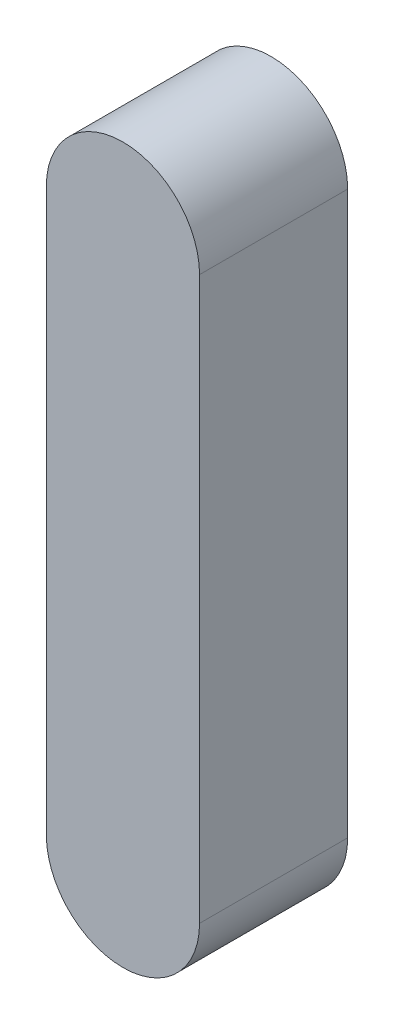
from build123d import *

# Parameters (mm, degrees)
EXTRUSION1_DEPTH = 2.9


with BuildPart() as part:
    # Esquisse1 → Extrusion1 (new body)
    with BuildSketch(Plane.XY):
        with BuildLine():
            Line((-7.227552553, 28.566041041), (-7.227552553, 17.566041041))
            ThreePointArc((-7.227552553, 17.566041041), (-5.727552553, 16.066041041), (-4.227552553, 17.566041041))
            Line((-4.227552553, 17.566041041), (-4.227552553, 28.566041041))
            ThreePointArc((-4.227552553, 28.566041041), (-5.727552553, 30.066041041), (-7.227552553, 28.566041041))
        make_face()
    extrude(amount=EXTRUSION1_DEPTH)


solid = part.part
